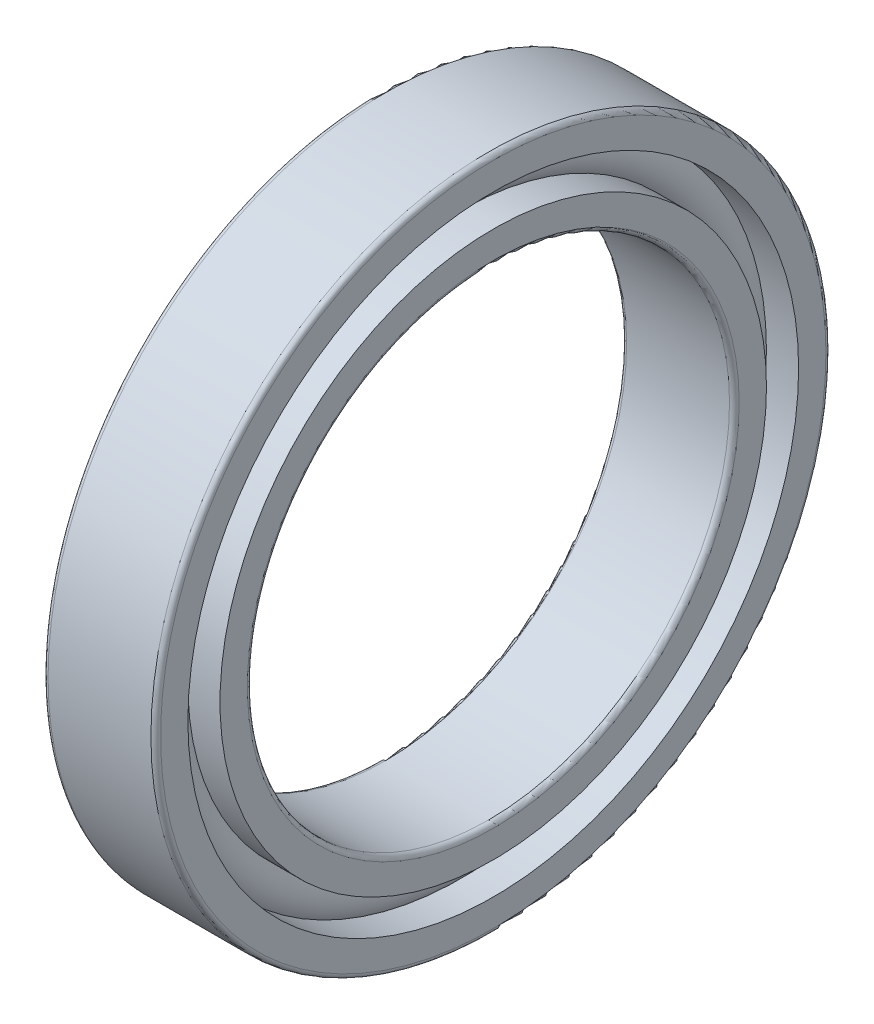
from build123d import *


with BuildPart() as part:
    # Skizze1 → Rotation1 (revolve)
    with BuildSketch(Plane.XY, mode=Mode.PRIVATE) as rotation1_sk:
        with BuildLine():
            Line((0, 20.7), (0, 19))
            Line((0, 19), (2.003337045, 19))
            ThreePointArc((2.003337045, 19), (1.7, 18), (2.003337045, 17))
            Line((2.003337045, 17), (0, 17))
            Line((0, 17), (0, 15.3))
            ThreePointArc((0, 15.3), (0.087867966, 15.087867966), (0.3, 15))
            Line((0.3, 15), (6.7, 15))
            ThreePointArc((6.7, 15), (6.912132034, 15.087867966), (7, 15.3))
            Line((7, 15.3), (7, 17))
            Line((7, 17), (4.996662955, 17))
            ThreePointArc((4.996662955, 17), (5.3, 18), (4.996662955, 19))
            Line((4.996662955, 19), (7, 19))
            Line((7, 19), (7, 20.7))
            ThreePointArc((7, 20.7), (6.912132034, 20.912132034), (6.7, 21))
            Line((6.7, 21), (0.3, 21))
            ThreePointArc((0.3, 21), (0.087867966, 20.912132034), (0, 20.7))
        make_face()
    revolve(rotation1_sk.sketch.rotate(Axis((7, 0, 0), (-1, 0, 0)), 90), axis=Axis((7, 0, 0), (-1, 0, 0)))


solid = part.part
